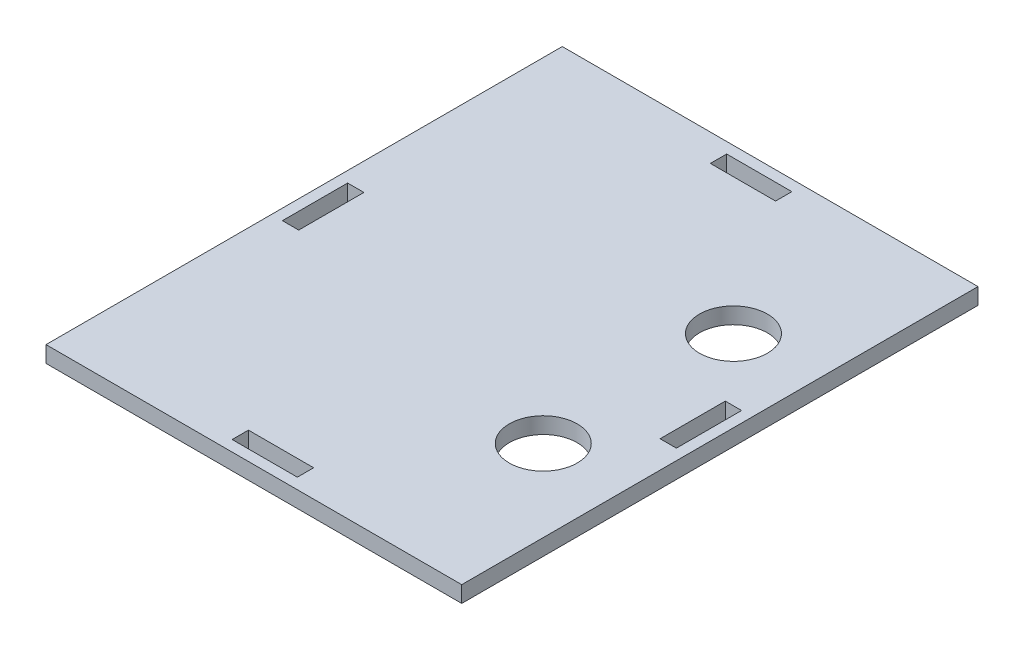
ISO-10303-21;
HEADER;
FILE_DESCRIPTION(('STEP AP214'),'2;1');
FILE_NAME('part.step','',(''),(''),'','','');
FILE_SCHEMA(('AUTOMOTIVE_DESIGN { 1 0 10303 214 1 1 1 1 }'));
ENDSEC;
DATA;
#1=APPLICATION_CONTEXT('core data for automotive mechanical design processes');
#2=APPLICATION_PROTOCOL_DEFINITION('international standard','automotive_design',2000,#1);
#3=PRODUCT_CONTEXT('',#1,'mechanical');
#4=PRODUCT('Part','Part','',(#3));
#5=PRODUCT_RELATED_PRODUCT_CATEGORY('part','',(#4));
#6=PRODUCT_DEFINITION_FORMATION('','',#4);
#7=PRODUCT_DEFINITION_CONTEXT('part definition',#1,'design');
#8=PRODUCT_DEFINITION('design','',#6,#7);
#9=PRODUCT_DEFINITION_SHAPE('','',#8);
#10=(LENGTH_UNIT() NAMED_UNIT(*) SI_UNIT(.MILLI.,.METRE.));
#11=(NAMED_UNIT(*) PLANE_ANGLE_UNIT() SI_UNIT($,.RADIAN.));
#12=(NAMED_UNIT(*) SI_UNIT($,.STERADIAN.) SOLID_ANGLE_UNIT());
#13=UNCERTAINTY_MEASURE_WITH_UNIT(LENGTH_MEASURE(1.E-05),#10,'distance_accuracy_value','');
#14=(GEOMETRIC_REPRESENTATION_CONTEXT(3) GLOBAL_UNCERTAINTY_ASSIGNED_CONTEXT((#13)) GLOBAL_UNIT_ASSIGNED_CONTEXT((#10,
#11,#12)) REPRESENTATION_CONTEXT('',''));
#15=CARTESIAN_POINT('',(0.,0.,0.));
#16=DIRECTION('',(0.,0.,1.));
#17=DIRECTION('',(1.,0.,0.));
#18=AXIS2_PLACEMENT_3D('',#15,#16,#17);
#19=CARTESIAN_POINT('',(0.,3.,-45.5));
#20=DIRECTION('',(0.,0.,-1.));
#21=DIRECTION('',(-1.,0.,0.));
#22=AXIS2_PLACEMENT_3D('',#19,#20,#21);
#23=PLANE('',#22);
#24=DIRECTION('',(1.,0.,0.));
#25=VECTOR('',#24,1.);
#26=CARTESIAN_POINT('',(0.,0.,-45.5));
#27=LINE('',#26,#25);
#28=CARTESIAN_POINT('',(-6.,0.,-45.5));
#29=VERTEX_POINT('',#28);
#30=CARTESIAN_POINT('',(6.,0.,-45.5));
#31=VERTEX_POINT('',#30);
#32=EDGE_CURVE('E251',#29,#31,#27,.T.);
#33=ORIENTED_EDGE('',*,*,#32,.T.);
#34=DIRECTION('',(0.,-1.,0.));
#35=VECTOR('',#34,1.);
#36=CARTESIAN_POINT('',(6.,3.,-45.5));
#37=LINE('',#36,#35);
#38=CARTESIAN_POINT('',(6.,3.,-45.5));
#39=VERTEX_POINT('',#38);
#40=EDGE_CURVE('E11',#39,#31,#37,.T.);
#41=ORIENTED_EDGE('',*,*,#40,.F.);
#42=DIRECTION('',(1.,0.,0.));
#43=VECTOR('',#42,1.);
#44=CARTESIAN_POINT('',(0.,3.,-45.5));
#45=LINE('',#44,#43);
#46=CARTESIAN_POINT('',(-6.,3.,-45.5));
#47=VERTEX_POINT('',#46);
#48=EDGE_CURVE('E186',#47,#39,#45,.T.);
#49=ORIENTED_EDGE('',*,*,#48,.F.);
#50=DIRECTION('',(0.,-1.,0.));
#51=VECTOR('',#50,1.);
#52=CARTESIAN_POINT('',(-6.,3.,-45.5));
#53=LINE('',#52,#51);
#54=EDGE_CURVE('E54',#47,#29,#53,.T.);
#55=ORIENTED_EDGE('',*,*,#54,.T.);
#56=EDGE_LOOP('',(#33,#41,#49,#55));
#57=FACE_BOUND('',#56,.T.);
#58=ADVANCED_FACE('F35',(#57),#23,.F.);
#59=CARTESIAN_POINT('',(6.,3.,0.));
#60=DIRECTION('',(1.,0.,0.));
#61=DIRECTION('',(0.,0.,-1.));
#62=AXIS2_PLACEMENT_3D('',#59,#60,#61);
#63=PLANE('',#62);
#64=DIRECTION('',(0.,0.,1.));
#65=VECTOR('',#64,1.);
#66=CARTESIAN_POINT('',(6.,0.,0.));
#67=LINE('',#66,#65);
#68=CARTESIAN_POINT('',(6.,0.,-42.5));
#69=VERTEX_POINT('',#68);
#70=EDGE_CURVE('E192',#31,#69,#67,.T.);
#71=ORIENTED_EDGE('',*,*,#70,.T.);
#72=DIRECTION('',(0.,-1.,0.));
#73=VECTOR('',#72,1.);
#74=CARTESIAN_POINT('',(6.,3.,-42.5));
#75=LINE('',#74,#73);
#76=CARTESIAN_POINT('',(6.,3.,-42.5));
#77=VERTEX_POINT('',#76);
#78=EDGE_CURVE('E45',#77,#69,#75,.T.);
#79=ORIENTED_EDGE('',*,*,#78,.F.);
#80=DIRECTION('',(0.,0.,1.));
#81=VECTOR('',#80,1.);
#82=CARTESIAN_POINT('',(6.,3.,0.));
#83=LINE('',#82,#81);
#84=EDGE_CURVE('E180',#39,#77,#83,.T.);
#85=ORIENTED_EDGE('',*,*,#84,.F.);
#86=ORIENTED_EDGE('',*,*,#40,.T.);
#87=EDGE_LOOP('',(#71,#79,#85,#86));
#88=FACE_BOUND('',#87,.T.);
#89=ADVANCED_FACE('F191',(#88),#63,.F.);
#90=CARTESIAN_POINT('',(0.,3.,-42.5));
#91=DIRECTION('',(0.,0.,-1.));
#92=DIRECTION('',(-1.,0.,0.));
#93=AXIS2_PLACEMENT_3D('',#90,#91,#92);
#94=PLANE('',#93);
#95=DIRECTION('',(1.,0.,0.));
#96=VECTOR('',#95,1.);
#97=CARTESIAN_POINT('',(0.,0.,-42.5));
#98=LINE('',#97,#96);
#99=CARTESIAN_POINT('',(-6.,0.,-42.5));
#100=VERTEX_POINT('',#99);
#101=EDGE_CURVE('E254',#100,#69,#98,.T.);
#102=ORIENTED_EDGE('',*,*,#101,.F.);
#103=DIRECTION('',(0.,-1.,0.));
#104=VECTOR('',#103,1.);
#105=CARTESIAN_POINT('',(-6.,3.,-42.5));
#106=LINE('',#105,#104);
#107=CARTESIAN_POINT('',(-6.,3.,-42.5));
#108=VERTEX_POINT('',#107);
#109=EDGE_CURVE('E116',#108,#100,#106,.T.);
#110=ORIENTED_EDGE('',*,*,#109,.F.);
#111=DIRECTION('',(1.,0.,0.));
#112=VECTOR('',#111,1.);
#113=CARTESIAN_POINT('',(0.,3.,-42.5));
#114=LINE('',#113,#112);
#115=EDGE_CURVE('E185',#108,#77,#114,.T.);
#116=ORIENTED_EDGE('',*,*,#115,.T.);
#117=ORIENTED_EDGE('',*,*,#78,.T.);
#118=EDGE_LOOP('',(#102,#110,#116,#117));
#119=FACE_BOUND('',#118,.T.);
#120=ADVANCED_FACE('F196',(#119),#94,.T.);
#121=CARTESIAN_POINT('',(0.,3.,45.5));
#122=DIRECTION('',(0.,0.,-1.));
#123=DIRECTION('',(-1.,0.,0.));
#124=AXIS2_PLACEMENT_3D('',#121,#122,#123);
#125=PLANE('',#124);
#126=DIRECTION('',(1.,0.,0.));
#127=VECTOR('',#126,1.);
#128=CARTESIAN_POINT('',(0.,0.,45.5));
#129=LINE('',#128,#127);
#130=CARTESIAN_POINT('',(-5.99999999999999,0.,45.5));
#131=VERTEX_POINT('',#130);
#132=CARTESIAN_POINT('',(6.00000000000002,0.,45.5));
#133=VERTEX_POINT('',#132);
#134=EDGE_CURVE('E239',#131,#133,#129,.T.);
#135=ORIENTED_EDGE('',*,*,#134,.F.);
#136=DIRECTION('',(0.,-1.,0.));
#137=VECTOR('',#136,1.);
#138=CARTESIAN_POINT('',(-5.99999999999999,3.,45.5));
#139=LINE('',#138,#137);
#140=CARTESIAN_POINT('',(-5.99999999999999,3.,45.5));
#141=VERTEX_POINT('',#140);
#142=EDGE_CURVE('E261',#141,#131,#139,.T.);
#143=ORIENTED_EDGE('',*,*,#142,.F.);
#144=DIRECTION('',(1.,0.,0.));
#145=VECTOR('',#144,1.);
#146=CARTESIAN_POINT('',(0.,3.,45.5));
#147=LINE('',#146,#145);
#148=CARTESIAN_POINT('',(6.00000000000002,3.,45.5));
#149=VERTEX_POINT('',#148);
#150=EDGE_CURVE('E546',#141,#149,#147,.T.);
#151=ORIENTED_EDGE('',*,*,#150,.T.);
#152=DIRECTION('',(0.,-1.,0.));
#153=VECTOR('',#152,1.);
#154=CARTESIAN_POINT('',(6.00000000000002,3.,45.5));
#155=LINE('',#154,#153);
#156=EDGE_CURVE('E263',#149,#133,#155,.T.);
#157=ORIENTED_EDGE('',*,*,#156,.T.);
#158=EDGE_LOOP('',(#135,#143,#151,#157));
#159=FACE_BOUND('',#158,.T.);
#160=ADVANCED_FACE('F339',(#159),#125,.T.);
#161=CARTESIAN_POINT('',(-5.99999999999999,3.,0.));
#162=DIRECTION('',(-1.,0.,0.));
#163=DIRECTION('',(0.,0.,1.));
#164=AXIS2_PLACEMENT_3D('',#161,#162,#163);
#165=PLANE('',#164);
#166=DIRECTION('',(0.,0.,-1.));
#167=VECTOR('',#166,1.);
#168=CARTESIAN_POINT('',(-5.99999999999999,0.,0.));
#169=LINE('',#168,#167);
#170=CARTESIAN_POINT('',(-5.99999999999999,0.,42.5));
#171=VERTEX_POINT('',#170);
#172=EDGE_CURVE('E242',#131,#171,#169,.T.);
#173=ORIENTED_EDGE('',*,*,#172,.T.);
#174=DIRECTION('',(0.,-1.,0.));
#175=VECTOR('',#174,1.);
#176=CARTESIAN_POINT('',(-5.99999999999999,3.,42.5));
#177=LINE('',#176,#175);
#178=CARTESIAN_POINT('',(-5.99999999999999,3.,42.5));
#179=VERTEX_POINT('',#178);
#180=EDGE_CURVE('E268',#179,#171,#177,.T.);
#181=ORIENTED_EDGE('',*,*,#180,.F.);
#182=DIRECTION('',(0.,0.,-1.));
#183=VECTOR('',#182,1.);
#184=CARTESIAN_POINT('',(-5.99999999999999,3.,0.));
#185=LINE('',#184,#183);
#186=EDGE_CURVE('E549',#141,#179,#185,.T.);
#187=ORIENTED_EDGE('',*,*,#186,.F.);
#188=ORIENTED_EDGE('',*,*,#142,.T.);
#189=EDGE_LOOP('',(#173,#181,#187,#188));
#190=FACE_BOUND('',#189,.T.);
#191=ADVANCED_FACE('F335',(#190),#165,.F.);
#192=CARTESIAN_POINT('',(0.,3.,42.5));
#193=DIRECTION('',(0.,0.,-1.));
#194=DIRECTION('',(-1.,0.,0.));
#195=AXIS2_PLACEMENT_3D('',#192,#193,#194);
#196=PLANE('',#195);
#197=DIRECTION('',(1.,0.,0.));
#198=VECTOR('',#197,1.);
#199=CARTESIAN_POINT('',(0.,0.,42.5));
#200=LINE('',#199,#198);
#201=CARTESIAN_POINT('',(6.00000000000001,0.,42.5));
#202=VERTEX_POINT('',#201);
#203=EDGE_CURVE('E245',#171,#202,#200,.T.);
#204=ORIENTED_EDGE('',*,*,#203,.T.);
#205=DIRECTION('',(0.,-1.,0.));
#206=VECTOR('',#205,1.);
#207=CARTESIAN_POINT('',(6.00000000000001,3.,42.5));
#208=LINE('',#207,#206);
#209=CARTESIAN_POINT('',(6.00000000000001,3.,42.5));
#210=VERTEX_POINT('',#209);
#211=EDGE_CURVE('E265',#210,#202,#208,.T.);
#212=ORIENTED_EDGE('',*,*,#211,.F.);
#213=DIRECTION('',(1.,0.,0.));
#214=VECTOR('',#213,1.);
#215=CARTESIAN_POINT('',(0.,3.,42.5));
#216=LINE('',#215,#214);
#217=EDGE_CURVE('E552',#179,#210,#216,.T.);
#218=ORIENTED_EDGE('',*,*,#217,.F.);
#219=ORIENTED_EDGE('',*,*,#180,.T.);
#220=EDGE_LOOP('',(#204,#212,#218,#219));
#221=FACE_BOUND('',#220,.T.);
#222=ADVANCED_FACE('F331',(#221),#196,.F.);
#223=CARTESIAN_POINT('',(-36.2500000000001,3.,1.25767452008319E-13));
#224=DIRECTION('',(1.,0.,0.));
#225=DIRECTION('',(0.,0.,-1.));
#226=AXIS2_PLACEMENT_3D('',#223,#224,#225);
#227=PLANE('',#226);
#228=DIRECTION('',(0.,0.,1.));
#229=VECTOR('',#228,1.);
#230=CARTESIAN_POINT('',(-36.2500000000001,0.,1.25767452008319E-13));
#231=LINE('',#230,#229);
#232=CARTESIAN_POINT('',(-36.2500000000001,0.,-5.99999999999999));
#233=VERTEX_POINT('',#232);
#234=CARTESIAN_POINT('',(-36.2500000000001,0.,6.00000000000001));
#235=VERTEX_POINT('',#234);
#236=EDGE_CURVE('E227',#233,#235,#231,.T.);
#237=ORIENTED_EDGE('',*,*,#236,.F.);
#238=DIRECTION('',(0.,-1.,0.));
#239=VECTOR('',#238,1.);
#240=CARTESIAN_POINT('',(-36.2500000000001,3.,-5.99999999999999));
#241=LINE('',#240,#239);
#242=CARTESIAN_POINT('',(-36.2500000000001,3.,-5.99999999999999));
#243=VERTEX_POINT('',#242);
#244=EDGE_CURVE('E266',#243,#233,#241,.T.);
#245=ORIENTED_EDGE('',*,*,#244,.F.);
#246=DIRECTION('',(0.,0.,1.));
#247=VECTOR('',#246,1.);
#248=CARTESIAN_POINT('',(-36.2500000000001,3.,1.25767452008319E-13));
#249=LINE('',#248,#247);
#250=CARTESIAN_POINT('',(-36.2500000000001,3.,6.00000000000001));
#251=VERTEX_POINT('',#250);
#252=EDGE_CURVE('E535',#243,#251,#249,.T.);
#253=ORIENTED_EDGE('',*,*,#252,.T.);
#254=DIRECTION('',(0.,-1.,0.));
#255=VECTOR('',#254,1.);
#256=CARTESIAN_POINT('',(-36.2500000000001,3.,6.00000000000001));
#257=LINE('',#256,#255);
#258=EDGE_CURVE('E272',#251,#235,#257,.T.);
#259=ORIENTED_EDGE('',*,*,#258,.T.);
#260=EDGE_LOOP('',(#237,#245,#253,#259));
#261=FACE_BOUND('',#260,.T.);
#262=ADVANCED_FACE('F334',(#261),#227,.T.);
#263=CARTESIAN_POINT('',(0.,3.,-5.99999999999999));
#264=DIRECTION('',(0.,0.,-1.));
#265=DIRECTION('',(-1.,0.,0.));
#266=AXIS2_PLACEMENT_3D('',#263,#264,#265);
#267=PLANE('',#266);
#268=DIRECTION('',(1.,0.,0.));
#269=VECTOR('',#268,1.);
#270=CARTESIAN_POINT('',(0.,0.,-5.99999999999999));
#271=LINE('',#270,#269);
#272=CARTESIAN_POINT('',(-33.25,0.,-5.99999999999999));
#273=VERTEX_POINT('',#272);
#274=EDGE_CURVE('E230',#233,#273,#271,.T.);
#275=ORIENTED_EDGE('',*,*,#274,.T.);
#276=DIRECTION('',(0.,-1.,0.));
#277=VECTOR('',#276,1.);
#278=CARTESIAN_POINT('',(-33.25,3.,-5.99999999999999));
#279=LINE('',#278,#277);
#280=CARTESIAN_POINT('',(-33.25,3.,-5.99999999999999));
#281=VERTEX_POINT('',#280);
#282=EDGE_CURVE('E277',#281,#273,#279,.T.);
#283=ORIENTED_EDGE('',*,*,#282,.F.);
#284=DIRECTION('',(1.,0.,0.));
#285=VECTOR('',#284,1.);
#286=CARTESIAN_POINT('',(0.,3.,-5.99999999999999));
#287=LINE('',#286,#285);
#288=EDGE_CURVE('E538',#243,#281,#287,.T.);
#289=ORIENTED_EDGE('',*,*,#288,.F.);
#290=ORIENTED_EDGE('',*,*,#244,.T.);
#291=EDGE_LOOP('',(#275,#283,#289,#290));
#292=FACE_BOUND('',#291,.T.);
#293=ADVANCED_FACE('F352',(#292),#267,.F.);
#294=CARTESIAN_POINT('',(-33.25,3.,0.));
#295=DIRECTION('',(1.,0.,0.));
#296=DIRECTION('',(0.,0.,-1.));
#297=AXIS2_PLACEMENT_3D('',#294,#295,#296);
#298=PLANE('',#297);
#299=DIRECTION('',(0.,0.,1.));
#300=VECTOR('',#299,1.);
#301=CARTESIAN_POINT('',(-33.25,0.,0.));
#302=LINE('',#301,#300);
#303=CARTESIAN_POINT('',(-33.25,0.,6.00000000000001));
#304=VERTEX_POINT('',#303);
#305=EDGE_CURVE('E233',#273,#304,#302,.T.);
#306=ORIENTED_EDGE('',*,*,#305,.T.);
#307=DIRECTION('',(0.,-1.,0.));
#308=VECTOR('',#307,1.);
#309=CARTESIAN_POINT('',(-33.25,3.,6.00000000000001));
#310=LINE('',#309,#308);
#311=CARTESIAN_POINT('',(-33.25,3.,6.00000000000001));
#312=VERTEX_POINT('',#311);
#313=EDGE_CURVE('E274',#312,#304,#310,.T.);
#314=ORIENTED_EDGE('',*,*,#313,.F.);
#315=DIRECTION('',(0.,0.,1.));
#316=VECTOR('',#315,1.);
#317=CARTESIAN_POINT('',(-33.25,3.,0.));
#318=LINE('',#317,#316);
#319=EDGE_CURVE('E541',#281,#312,#318,.T.);
#320=ORIENTED_EDGE('',*,*,#319,.F.);
#321=ORIENTED_EDGE('',*,*,#282,.T.);
#322=EDGE_LOOP('',(#306,#314,#320,#321));
#323=FACE_BOUND('',#322,.T.);
#324=ADVANCED_FACE('F348',(#323),#298,.F.);
#325=CARTESIAN_POINT('',(0.,3.,-5.99999999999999));
#326=DIRECTION('',(0.,0.,1.));
#327=DIRECTION('',(1.,0.,0.));
#328=AXIS2_PLACEMENT_3D('',#325,#326,#327);
#329=PLANE('',#328);
#330=DIRECTION('',(-1.,0.,0.));
#331=VECTOR('',#330,1.);
#332=CARTESIAN_POINT('',(0.,0.,-5.99999999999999));
#333=LINE('',#332,#331);
#334=CARTESIAN_POINT('',(36.2499999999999,0.,-5.99999999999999));
#335=VERTEX_POINT('',#334);
#336=CARTESIAN_POINT('',(33.25,0.,-5.99999999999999));
#337=VERTEX_POINT('',#336);
#338=EDGE_CURVE('E215',#335,#337,#333,.T.);
#339=ORIENTED_EDGE('',*,*,#338,.F.);
#340=DIRECTION('',(0.,-1.,0.));
#341=VECTOR('',#340,1.);
#342=CARTESIAN_POINT('',(36.2499999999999,3.,-5.99999999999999));
#343=LINE('',#342,#341);
#344=CARTESIAN_POINT('',(36.2499999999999,3.,-5.99999999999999));
#345=VERTEX_POINT('',#344);
#346=EDGE_CURVE('E275',#345,#335,#343,.T.);
#347=ORIENTED_EDGE('',*,*,#346,.F.);
#348=DIRECTION('',(-1.,0.,0.));
#349=VECTOR('',#348,1.);
#350=CARTESIAN_POINT('',(0.,3.,-5.99999999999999));
#351=LINE('',#350,#349);
#352=CARTESIAN_POINT('',(33.25,3.,-5.99999999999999));
#353=VERTEX_POINT('',#352);
#354=EDGE_CURVE('E524',#345,#353,#351,.T.);
#355=ORIENTED_EDGE('',*,*,#354,.T.);
#356=DIRECTION('',(0.,-1.,0.));
#357=VECTOR('',#356,1.);
#358=CARTESIAN_POINT('',(33.25,3.,-5.99999999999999));
#359=LINE('',#358,#357);
#360=EDGE_CURVE('E281',#353,#337,#359,.T.);
#361=ORIENTED_EDGE('',*,*,#360,.T.);
#362=EDGE_LOOP('',(#339,#347,#355,#361));
#363=FACE_BOUND('',#362,.T.);
#364=ADVANCED_FACE('F351',(#363),#329,.T.);
#365=CARTESIAN_POINT('',(36.2499999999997,3.,2.51534904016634E-13));
#366=DIRECTION('',(-1.,0.,0.));
#367=DIRECTION('',(0.,0.,1.));
#368=AXIS2_PLACEMENT_3D('',#365,#366,#367);
#369=PLANE('',#368);
#370=DIRECTION('',(0.,0.,-1.));
#371=VECTOR('',#370,1.);
#372=CARTESIAN_POINT('',(36.2499999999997,0.,2.51534904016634E-13));
#373=LINE('',#372,#371);
#374=CARTESIAN_POINT('',(36.2499999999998,0.,6.00000000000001));
#375=VERTEX_POINT('',#374);
#376=EDGE_CURVE('E218',#375,#335,#373,.T.);
#377=ORIENTED_EDGE('',*,*,#376,.F.);
#378=DIRECTION('',(0.,-1.,0.));
#379=VECTOR('',#378,1.);
#380=CARTESIAN_POINT('',(36.2499999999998,3.,6.00000000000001));
#381=LINE('',#380,#379);
#382=CARTESIAN_POINT('',(36.2499999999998,3.,6.00000000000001));
#383=VERTEX_POINT('',#382);
#384=EDGE_CURVE('E285',#383,#375,#381,.T.);
#385=ORIENTED_EDGE('',*,*,#384,.F.);
#386=DIRECTION('',(0.,0.,-1.));
#387=VECTOR('',#386,1.);
#388=CARTESIAN_POINT('',(36.2499999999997,3.,2.51534904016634E-13));
#389=LINE('',#388,#387);
#390=EDGE_CURVE('E527',#383,#345,#389,.T.);
#391=ORIENTED_EDGE('',*,*,#390,.T.);
#392=ORIENTED_EDGE('',*,*,#346,.T.);
#393=EDGE_LOOP('',(#377,#385,#391,#392));
#394=FACE_BOUND('',#393,.T.);
#395=ADVANCED_FACE('F366',(#394),#369,.T.);
#396=CARTESIAN_POINT('',(0.,3.,5.99999999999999));
#397=DIRECTION('',(0.,0.,1.));
#398=DIRECTION('',(1.,0.,0.));
#399=AXIS2_PLACEMENT_3D('',#396,#397,#398);
#400=PLANE('',#399);
#401=DIRECTION('',(-1.,0.,0.));
#402=VECTOR('',#401,1.);
#403=CARTESIAN_POINT('',(0.,0.,5.99999999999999));
#404=LINE('',#403,#402);
#405=CARTESIAN_POINT('',(33.25,0.,6.00000000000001));
#406=VERTEX_POINT('',#405);
#407=EDGE_CURVE('E221',#375,#406,#404,.T.);
#408=ORIENTED_EDGE('',*,*,#407,.T.);
#409=DIRECTION('',(0.,-1.,0.));
#410=VECTOR('',#409,1.);
#411=CARTESIAN_POINT('',(33.25,3.,6.00000000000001));
#412=LINE('',#411,#410);
#413=CARTESIAN_POINT('',(33.25,3.,6.00000000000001));
#414=VERTEX_POINT('',#413);
#415=EDGE_CURVE('E283',#414,#406,#412,.T.);
#416=ORIENTED_EDGE('',*,*,#415,.F.);
#417=DIRECTION('',(-1.,0.,0.));
#418=VECTOR('',#417,1.);
#419=CARTESIAN_POINT('',(0.,3.,5.99999999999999));
#420=LINE('',#419,#418);
#421=EDGE_CURVE('E530',#383,#414,#420,.T.);
#422=ORIENTED_EDGE('',*,*,#421,.F.);
#423=ORIENTED_EDGE('',*,*,#384,.T.);
#424=EDGE_LOOP('',(#408,#416,#422,#423));
#425=FACE_BOUND('',#424,.T.);
#426=ADVANCED_FACE('F363',(#425),#400,.F.);
#427=CARTESIAN_POINT('',(0.,3.,-47.5));
#428=DIRECTION('',(0.,0.,-1.));
#429=DIRECTION('',(-1.,0.,0.));
#430=AXIS2_PLACEMENT_3D('',#427,#428,#429);
#431=PLANE('',#430);
#432=DIRECTION('',(1.,0.,0.));
#433=VECTOR('',#432,1.);
#434=CARTESIAN_POINT('',(0.,0.,-47.5));
#435=LINE('',#434,#433);
#436=CARTESIAN_POINT('',(-38.25,0.,-47.5));
#437=VERTEX_POINT('',#436);
#438=CARTESIAN_POINT('',(38.25,0.,-47.5));
#439=VERTEX_POINT('',#438);
#440=EDGE_CURVE('E203',#437,#439,#435,.T.);
#441=ORIENTED_EDGE('',*,*,#440,.F.);
#442=DIRECTION('',(0.,-1.,0.));
#443=VECTOR('',#442,1.);
#444=CARTESIAN_POINT('',(-38.25,3.,-47.5));
#445=LINE('',#444,#443);
#446=CARTESIAN_POINT('',(-38.25,3.,-47.5));
#447=VERTEX_POINT('',#446);
#448=EDGE_CURVE('E39',#447,#437,#445,.T.);
#449=ORIENTED_EDGE('',*,*,#448,.F.);
#450=DIRECTION('',(1.,0.,0.));
#451=VECTOR('',#450,1.);
#452=CARTESIAN_POINT('',(0.,3.,-47.5));
#453=LINE('',#452,#451);
#454=CARTESIAN_POINT('',(38.25,3.,-47.5));
#455=VERTEX_POINT('',#454);
#456=EDGE_CURVE('E259',#447,#455,#453,.T.);
#457=ORIENTED_EDGE('',*,*,#456,.T.);
#458=DIRECTION('',(0.,-1.,0.));
#459=VECTOR('',#458,1.);
#460=CARTESIAN_POINT('',(38.25,3.,-47.5));
#461=LINE('',#460,#459);
#462=EDGE_CURVE('E199',#455,#439,#461,.T.);
#463=ORIENTED_EDGE('',*,*,#462,.T.);
#464=EDGE_LOOP('',(#441,#449,#457,#463));
#465=FACE_BOUND('',#464,.T.);
#466=ADVANCED_FACE('F37',(#465),#431,.T.);
#467=CARTESIAN_POINT('',(-38.25,3.,0.));
#468=DIRECTION('',(1.,0.,0.));
#469=DIRECTION('',(0.,0.,-1.));
#470=AXIS2_PLACEMENT_3D('',#467,#468,#469);
#471=PLANE('',#470);
#472=DIRECTION('',(0.,0.,1.));
#473=VECTOR('',#472,1.);
#474=CARTESIAN_POINT('',(-38.25,0.,0.));
#475=LINE('',#474,#473);
#476=CARTESIAN_POINT('',(-38.25,0.,47.5));
#477=VERTEX_POINT('',#476);
#478=EDGE_CURVE('E206',#437,#477,#475,.T.);
#479=ORIENTED_EDGE('',*,*,#478,.T.);
#480=DIRECTION('',(0.,-1.,0.));
#481=VECTOR('',#480,1.);
#482=CARTESIAN_POINT('',(-38.25,3.,47.5));
#483=LINE('',#482,#481);
#484=CARTESIAN_POINT('',(-38.25,3.,47.5));
#485=VERTEX_POINT('',#484);
#486=EDGE_CURVE('E290',#485,#477,#483,.T.);
#487=ORIENTED_EDGE('',*,*,#486,.F.);
#488=DIRECTION('',(0.,0.,1.));
#489=VECTOR('',#488,1.);
#490=CARTESIAN_POINT('',(-38.25,3.,0.));
#491=LINE('',#490,#489);
#492=EDGE_CURVE('E299',#447,#485,#491,.T.);
#493=ORIENTED_EDGE('',*,*,#492,.F.);
#494=ORIENTED_EDGE('',*,*,#448,.T.);
#495=EDGE_LOOP('',(#479,#487,#493,#494));
#496=FACE_BOUND('',#495,.T.);
#497=ADVANCED_FACE('F298',(#496),#471,.F.);
#498=CARTESIAN_POINT('',(0.,3.,47.5));
#499=DIRECTION('',(0.,0.,-1.));
#500=DIRECTION('',(-1.,0.,0.));
#501=AXIS2_PLACEMENT_3D('',#498,#499,#500);
#502=PLANE('',#501);
#503=DIRECTION('',(1.,0.,0.));
#504=VECTOR('',#503,1.);
#505=CARTESIAN_POINT('',(0.,0.,47.5));
#506=LINE('',#505,#504);
#507=CARTESIAN_POINT('',(38.25,0.,47.5));
#508=VERTEX_POINT('',#507);
#509=EDGE_CURVE('E209',#477,#508,#506,.T.);
#510=ORIENTED_EDGE('',*,*,#509,.T.);
#511=DIRECTION('',(0.,-1.,0.));
#512=VECTOR('',#511,1.);
#513=CARTESIAN_POINT('',(38.25,3.,47.5));
#514=LINE('',#513,#512);
#515=CARTESIAN_POINT('',(38.25,3.,47.5));
#516=VERTEX_POINT('',#515);
#517=EDGE_CURVE('E289',#516,#508,#514,.T.);
#518=ORIENTED_EDGE('',*,*,#517,.F.);
#519=DIRECTION('',(1.,0.,0.));
#520=VECTOR('',#519,1.);
#521=CARTESIAN_POINT('',(0.,3.,47.5));
#522=LINE('',#521,#520);
#523=EDGE_CURVE('E521',#485,#516,#522,.T.);
#524=ORIENTED_EDGE('',*,*,#523,.F.);
#525=ORIENTED_EDGE('',*,*,#486,.T.);
#526=EDGE_LOOP('',(#510,#518,#524,#525));
#527=FACE_BOUND('',#526,.T.);
#528=ADVANCED_FACE('F311',(#527),#502,.F.);
#529=CARTESIAN_POINT('',(5.99999999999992,3.,0.));
#530=DIRECTION('',(-1.,0.,0.));
#531=DIRECTION('',(0.,0.,1.));
#532=AXIS2_PLACEMENT_3D('',#529,#530,#531);
#533=PLANE('',#532);
#534=DIRECTION('',(0.,0.,-1.));
#535=VECTOR('',#534,1.);
#536=CARTESIAN_POINT('',(5.99999999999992,0.,0.));
#537=LINE('',#536,#535);
#538=EDGE_CURVE('E248',#133,#202,#537,.T.);
#539=ORIENTED_EDGE('',*,*,#538,.F.);
#540=ORIENTED_EDGE('',*,*,#156,.F.);
#541=DIRECTION('',(0.,0.,-1.));
#542=VECTOR('',#541,1.);
#543=CARTESIAN_POINT('',(5.99999999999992,3.,0.));
#544=LINE('',#543,#542);
#545=EDGE_CURVE('E554',#149,#210,#544,.T.);
#546=ORIENTED_EDGE('',*,*,#545,.T.);
#547=ORIENTED_EDGE('',*,*,#211,.T.);
#548=EDGE_LOOP('',(#539,#540,#546,#547));
#549=FACE_BOUND('',#548,.T.);
#550=ADVANCED_FACE('F313',(#549),#533,.T.);
#551=CARTESIAN_POINT('',(0.,3.,5.99999999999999));
#552=DIRECTION('',(0.,0.,-1.));
#553=DIRECTION('',(-1.,0.,0.));
#554=AXIS2_PLACEMENT_3D('',#551,#552,#553);
#555=PLANE('',#554);
#556=DIRECTION('',(1.,0.,0.));
#557=VECTOR('',#556,1.);
#558=CARTESIAN_POINT('',(0.,0.,5.99999999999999));
#559=LINE('',#558,#557);
#560=EDGE_CURVE('E236',#235,#304,#559,.T.);
#561=ORIENTED_EDGE('',*,*,#560,.F.);
#562=ORIENTED_EDGE('',*,*,#258,.F.);
#563=DIRECTION('',(1.,0.,0.));
#564=VECTOR('',#563,1.);
#565=CARTESIAN_POINT('',(0.,3.,5.99999999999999));
#566=LINE('',#565,#564);
#567=EDGE_CURVE('E543',#251,#312,#566,.T.);
#568=ORIENTED_EDGE('',*,*,#567,.T.);
#569=ORIENTED_EDGE('',*,*,#313,.T.);
#570=EDGE_LOOP('',(#561,#562,#568,#569));
#571=FACE_BOUND('',#570,.T.);
#572=ADVANCED_FACE('F319',(#571),#555,.T.);
#573=CARTESIAN_POINT('',(33.25,3.,0.));
#574=DIRECTION('',(1.,0.,0.));
#575=DIRECTION('',(0.,0.,-1.));
#576=AXIS2_PLACEMENT_3D('',#573,#574,#575);
#577=PLANE('',#576);
#578=DIRECTION('',(0.,0.,1.));
#579=VECTOR('',#578,1.);
#580=CARTESIAN_POINT('',(33.25,0.,0.));
#581=LINE('',#580,#579);
#582=EDGE_CURVE('E224',#337,#406,#581,.T.);
#583=ORIENTED_EDGE('',*,*,#582,.F.);
#584=ORIENTED_EDGE('',*,*,#360,.F.);
#585=DIRECTION('',(0.,0.,1.));
#586=VECTOR('',#585,1.);
#587=CARTESIAN_POINT('',(33.25,3.,0.));
#588=LINE('',#587,#586);
#589=EDGE_CURVE('E532',#353,#414,#588,.T.);
#590=ORIENTED_EDGE('',*,*,#589,.T.);
#591=ORIENTED_EDGE('',*,*,#415,.T.);
#592=EDGE_LOOP('',(#583,#584,#590,#591));
#593=FACE_BOUND('',#592,.T.);
#594=ADVANCED_FACE('F346',(#593),#577,.T.);
#595=CARTESIAN_POINT('',(38.25,3.,0.));
#596=DIRECTION('',(1.,0.,0.));
#597=DIRECTION('',(0.,0.,-1.));
#598=AXIS2_PLACEMENT_3D('',#595,#596,#597);
#599=PLANE('',#598);
#600=DIRECTION('',(0.,0.,1.));
#601=VECTOR('',#600,1.);
#602=CARTESIAN_POINT('',(38.25,0.,0.));
#603=LINE('',#602,#601);
#604=EDGE_CURVE('E212',#439,#508,#603,.T.);
#605=ORIENTED_EDGE('',*,*,#604,.F.);
#606=ORIENTED_EDGE('',*,*,#462,.F.);
#607=DIRECTION('',(0.,0.,1.));
#608=VECTOR('',#607,1.);
#609=CARTESIAN_POINT('',(38.25,3.,0.));
#610=LINE('',#609,#608);
#611=EDGE_CURVE('E309',#455,#516,#610,.T.);
#612=ORIENTED_EDGE('',*,*,#611,.T.);
#613=ORIENTED_EDGE('',*,*,#517,.T.);
#614=EDGE_LOOP('',(#605,#606,#612,#613));
#615=FACE_BOUND('',#614,.T.);
#616=ADVANCED_FACE('F308',(#615),#599,.T.);
#617=CARTESIAN_POINT('',(-6.,3.,0.));
#618=DIRECTION('',(1.,0.,0.));
#619=DIRECTION('',(0.,0.,-1.));
#620=AXIS2_PLACEMENT_3D('',#617,#618,#619);
#621=PLANE('',#620);
#622=DIRECTION('',(0.,0.,1.));
#623=VECTOR('',#622,1.);
#624=CARTESIAN_POINT('',(-6.,0.,0.));
#625=LINE('',#624,#623);
#626=EDGE_CURVE('E256',#29,#100,#625,.T.);
#627=ORIENTED_EDGE('',*,*,#626,.F.);
#628=ORIENTED_EDGE('',*,*,#54,.F.);
#629=DIRECTION('',(0.,0.,1.));
#630=VECTOR('',#629,1.);
#631=CARTESIAN_POINT('',(-6.,3.,0.));
#632=LINE('',#631,#630);
#633=EDGE_CURVE('E197',#47,#108,#632,.T.);
#634=ORIENTED_EDGE('',*,*,#633,.T.);
#635=ORIENTED_EDGE('',*,*,#109,.T.);
#636=EDGE_LOOP('',(#627,#628,#634,#635));
#637=FACE_BOUND('',#636,.T.);
#638=ADVANCED_FACE('F374',(#637),#621,.T.);
#639=CARTESIAN_POINT('',(0.,3.,0.));
#640=DIRECTION('',(0.,1.,0.));
#641=DIRECTION('',(0.,0.,1.));
#642=AXIS2_PLACEMENT_3D('',#639,#640,#641);
#643=PLANE('',#642);
#644=CARTESIAN_POINT('',(23.25,3.,17.5));
#645=DIRECTION('',(0.,1.,0.));
#646=DIRECTION('',(0.,0.,1.));
#647=AXIS2_PLACEMENT_3D('',#644,#645,#646);
#648=CIRCLE('',#647,6.25);
#649=CARTESIAN_POINT('',(23.25,3.,23.75));
#650=VERTEX_POINT('',#649);
#651=EDGE_CURVE('E510',#650,#650,#648,.T.);
#652=ORIENTED_EDGE('',*,*,#651,.F.);
#653=EDGE_LOOP('',(#652));
#654=FACE_BOUND('',#653,.T.);
#655=CARTESIAN_POINT('',(23.25,3.,-17.5));
#656=DIRECTION('',(0.,1.,0.));
#657=DIRECTION('',(0.,0.,1.));
#658=AXIS2_PLACEMENT_3D('',#655,#656,#657);
#659=CIRCLE('',#658,6.25);
#660=CARTESIAN_POINT('',(23.25,3.,-11.25));
#661=VERTEX_POINT('',#660);
#662=EDGE_CURVE('E512',#661,#661,#659,.T.);
#663=ORIENTED_EDGE('',*,*,#662,.F.);
#664=EDGE_LOOP('',(#663));
#665=FACE_BOUND('',#664,.T.);
#666=ORIENTED_EDGE('',*,*,#456,.F.);
#667=ORIENTED_EDGE('',*,*,#492,.T.);
#668=ORIENTED_EDGE('',*,*,#523,.T.);
#669=ORIENTED_EDGE('',*,*,#611,.F.);
#670=EDGE_LOOP('',(#666,#667,#668,#669));
#671=FACE_BOUND('',#670,.T.);
#672=ORIENTED_EDGE('',*,*,#354,.F.);
#673=ORIENTED_EDGE('',*,*,#390,.F.);
#674=ORIENTED_EDGE('',*,*,#421,.T.);
#675=ORIENTED_EDGE('',*,*,#589,.F.);
#676=EDGE_LOOP('',(#672,#673,#674,#675));
#677=FACE_BOUND('',#676,.T.);
#678=ORIENTED_EDGE('',*,*,#252,.F.);
#679=ORIENTED_EDGE('',*,*,#288,.T.);
#680=ORIENTED_EDGE('',*,*,#319,.T.);
#681=ORIENTED_EDGE('',*,*,#567,.F.);
#682=EDGE_LOOP('',(#678,#679,#680,#681));
#683=FACE_BOUND('',#682,.T.);
#684=ORIENTED_EDGE('',*,*,#150,.F.);
#685=ORIENTED_EDGE('',*,*,#186,.T.);
#686=ORIENTED_EDGE('',*,*,#217,.T.);
#687=ORIENTED_EDGE('',*,*,#545,.F.);
#688=EDGE_LOOP('',(#684,#685,#686,#687));
#689=FACE_BOUND('',#688,.T.);
#690=ORIENTED_EDGE('',*,*,#48,.T.);
#691=ORIENTED_EDGE('',*,*,#84,.T.);
#692=ORIENTED_EDGE('',*,*,#115,.F.);
#693=ORIENTED_EDGE('',*,*,#633,.F.);
#694=EDGE_LOOP('',(#690,#691,#692,#693));
#695=FACE_BOUND('',#694,.T.);
#696=ADVANCED_FACE('F182',(#654,#665,#671,#677,#683,#689,#695),#643,.T.);
#697=CARTESIAN_POINT('',(0.,0.,0.));
#698=DIRECTION('',(0.,1.,0.));
#699=DIRECTION('',(0.,0.,1.));
#700=AXIS2_PLACEMENT_3D('',#697,#698,#699);
#701=PLANE('',#700);
#702=CARTESIAN_POINT('',(23.25,0.,17.5));
#703=DIRECTION('',(0.,1.,0.));
#704=DIRECTION('',(0.,0.,1.));
#705=AXIS2_PLACEMENT_3D('',#702,#703,#704);
#706=CIRCLE('',#705,6.25);
#707=CARTESIAN_POINT('',(23.25,0.,23.75));
#708=VERTEX_POINT('',#707);
#709=EDGE_CURVE('E507',#708,#708,#706,.T.);
#710=ORIENTED_EDGE('',*,*,#709,.T.);
#711=EDGE_LOOP('',(#710));
#712=FACE_BOUND('',#711,.T.);
#713=CARTESIAN_POINT('',(23.25,0.,-17.5));
#714=DIRECTION('',(0.,1.,0.));
#715=DIRECTION('',(0.,0.,1.));
#716=AXIS2_PLACEMENT_3D('',#713,#714,#715);
#717=CIRCLE('',#716,6.25);
#718=CARTESIAN_POINT('',(23.25,0.,-11.25));
#719=VERTEX_POINT('',#718);
#720=EDGE_CURVE('E207',#719,#719,#717,.T.);
#721=ORIENTED_EDGE('',*,*,#720,.T.);
#722=EDGE_LOOP('',(#721));
#723=FACE_BOUND('',#722,.T.);
#724=ORIENTED_EDGE('',*,*,#440,.T.);
#725=ORIENTED_EDGE('',*,*,#604,.T.);
#726=ORIENTED_EDGE('',*,*,#509,.F.);
#727=ORIENTED_EDGE('',*,*,#478,.F.);
#728=EDGE_LOOP('',(#724,#725,#726,#727));
#729=FACE_BOUND('',#728,.T.);
#730=ORIENTED_EDGE('',*,*,#338,.T.);
#731=ORIENTED_EDGE('',*,*,#582,.T.);
#732=ORIENTED_EDGE('',*,*,#407,.F.);
#733=ORIENTED_EDGE('',*,*,#376,.T.);
#734=EDGE_LOOP('',(#730,#731,#732,#733));
#735=FACE_BOUND('',#734,.T.);
#736=ORIENTED_EDGE('',*,*,#236,.T.);
#737=ORIENTED_EDGE('',*,*,#560,.T.);
#738=ORIENTED_EDGE('',*,*,#305,.F.);
#739=ORIENTED_EDGE('',*,*,#274,.F.);
#740=EDGE_LOOP('',(#736,#737,#738,#739));
#741=FACE_BOUND('',#740,.T.);
#742=ORIENTED_EDGE('',*,*,#134,.T.);
#743=ORIENTED_EDGE('',*,*,#538,.T.);
#744=ORIENTED_EDGE('',*,*,#203,.F.);
#745=ORIENTED_EDGE('',*,*,#172,.F.);
#746=EDGE_LOOP('',(#742,#743,#744,#745));
#747=FACE_BOUND('',#746,.T.);
#748=ORIENTED_EDGE('',*,*,#32,.F.);
#749=ORIENTED_EDGE('',*,*,#626,.T.);
#750=ORIENTED_EDGE('',*,*,#101,.T.);
#751=ORIENTED_EDGE('',*,*,#70,.F.);
#752=EDGE_LOOP('',(#748,#749,#750,#751));
#753=FACE_BOUND('',#752,.T.);
#754=ADVANCED_FACE('F302',(#712,#723,#729,#735,#741,#747,#753),#701,.F.);
#755=CARTESIAN_POINT('',(23.25,0.,-17.5));
#756=DIRECTION('',(0.,1.,0.));
#757=DIRECTION('',(0.,0.,1.));
#758=AXIS2_PLACEMENT_3D('',#755,#756,#757);
#759=CYLINDRICAL_SURFACE('',#758,6.25);
#760=ORIENTED_EDGE('',*,*,#720,.F.);
#761=EDGE_LOOP('',(#760));
#762=FACE_BOUND('',#761,.T.);
#763=ORIENTED_EDGE('',*,*,#662,.T.);
#764=EDGE_LOOP('',(#763));
#765=FACE_BOUND('',#764,.T.);
#766=ADVANCED_FACE('F482',(#762,#765),#759,.F.);
#767=CARTESIAN_POINT('',(23.25,0.,17.5));
#768=DIRECTION('',(0.,1.,0.));
#769=DIRECTION('',(0.,0.,1.));
#770=AXIS2_PLACEMENT_3D('',#767,#768,#769);
#771=CYLINDRICAL_SURFACE('',#770,6.25);
#772=ORIENTED_EDGE('',*,*,#709,.F.);
#773=EDGE_LOOP('',(#772));
#774=FACE_BOUND('',#773,.T.);
#775=ORIENTED_EDGE('',*,*,#651,.T.);
#776=EDGE_LOOP('',(#775));
#777=FACE_BOUND('',#776,.T.);
#778=ADVANCED_FACE('F490',(#774,#777),#771,.F.);
#779=CLOSED_SHELL('',(#58,#89,#120,#160,#191,#222,#262,#293,#324,#364,#395,#426,#466,#497,#528,
#550,#572,#594,#616,#638,#696,#754,#766,#778));
#780=MANIFOLD_SOLID_BREP('B2',#779);
#781=ADVANCED_BREP_SHAPE_REPRESENTATION('',(#18,#780),#14);
#782=SHAPE_DEFINITION_REPRESENTATION(#9,#781);
ENDSEC;
END-ISO-10303-21;
